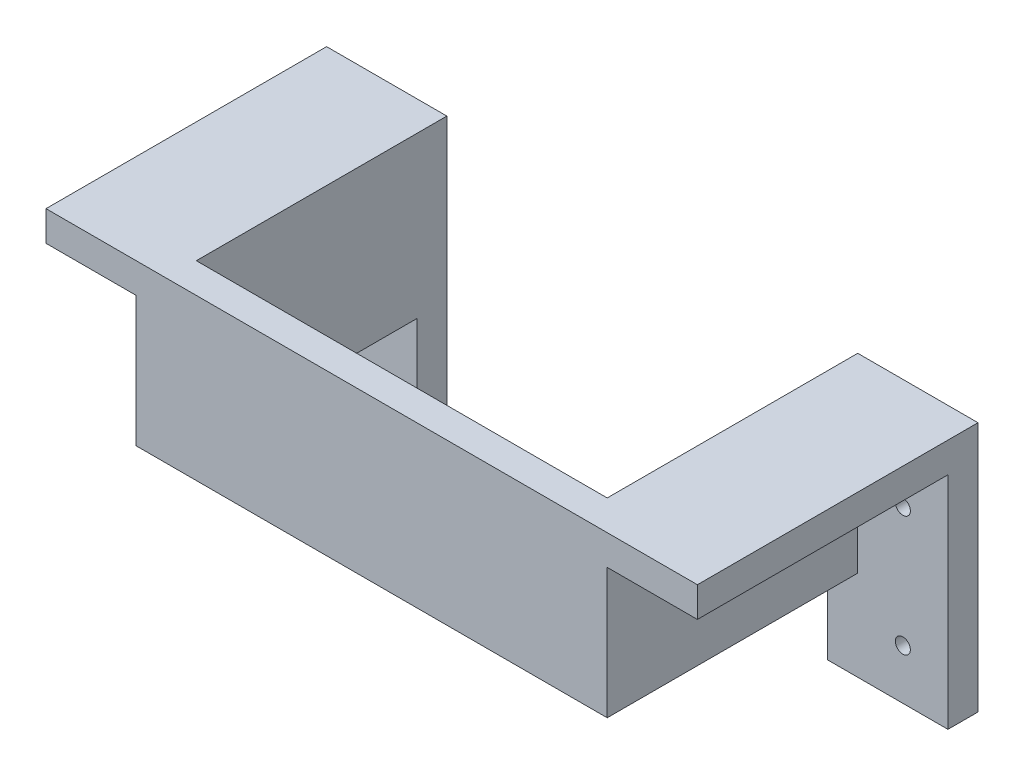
ISO-10303-21;
HEADER;
FILE_DESCRIPTION(('STEP AP214'),'2;1');
FILE_NAME('part.step','',(''),(''),'','','');
FILE_SCHEMA(('AUTOMOTIVE_DESIGN { 1 0 10303 214 1 1 1 1 }'));
ENDSEC;
DATA;
#1=APPLICATION_CONTEXT('core data for automotive mechanical design processes');
#2=APPLICATION_PROTOCOL_DEFINITION('international standard','automotive_design',2000,#1);
#3=PRODUCT_CONTEXT('',#1,'mechanical');
#4=PRODUCT('Part','Part','',(#3));
#5=PRODUCT_RELATED_PRODUCT_CATEGORY('part','',(#4));
#6=PRODUCT_DEFINITION_FORMATION('','',#4);
#7=PRODUCT_DEFINITION_CONTEXT('part definition',#1,'design');
#8=PRODUCT_DEFINITION('design','',#6,#7);
#9=PRODUCT_DEFINITION_SHAPE('','',#8);
#10=(LENGTH_UNIT() NAMED_UNIT(*) SI_UNIT(.MILLI.,.METRE.));
#11=(NAMED_UNIT(*) PLANE_ANGLE_UNIT() SI_UNIT($,.RADIAN.));
#12=(NAMED_UNIT(*) SI_UNIT($,.STERADIAN.) SOLID_ANGLE_UNIT());
#13=UNCERTAINTY_MEASURE_WITH_UNIT(LENGTH_MEASURE(1.E-05),#10,'distance_accuracy_value','');
#14=(GEOMETRIC_REPRESENTATION_CONTEXT(3) GLOBAL_UNCERTAINTY_ASSIGNED_CONTEXT((#13)) GLOBAL_UNIT_ASSIGNED_CONTEXT((#10,
#11,#12)) REPRESENTATION_CONTEXT('',''));
#15=CARTESIAN_POINT('',(0.,0.,0.));
#16=DIRECTION('',(0.,0.,1.));
#17=DIRECTION('',(1.,0.,0.));
#18=AXIS2_PLACEMENT_3D('',#15,#16,#17);
#19=CARTESIAN_POINT('',(-53.,0.,28.));
#20=DIRECTION('',(-1.,0.,0.));
#21=DIRECTION('',(0.,0.,1.));
#22=AXIS2_PLACEMENT_3D('',#19,#20,#21);
#23=PLANE('',#22);
#24=DIRECTION('',(0.,1.,0.));
#25=VECTOR('',#24,1.);
#26=CARTESIAN_POINT('',(-53.,0.,25.));
#27=LINE('',#26,#25);
#28=CARTESIAN_POINT('',(-53.,-16.,25.));
#29=VERTEX_POINT('',#28);
#30=CARTESIAN_POINT('',(-53.,0.,25.));
#31=VERTEX_POINT('',#30);
#32=EDGE_CURVE('E52',#29,#31,#27,.T.);
#33=ORIENTED_EDGE('',*,*,#32,.F.);
#34=DIRECTION('',(0.,0.,-1.));
#35=VECTOR('',#34,1.);
#36=CARTESIAN_POINT('',(-53.,-16.,28.));
#37=LINE('',#36,#35);
#38=CARTESIAN_POINT('',(-53.,-16.,3.));
#39=VERTEX_POINT('',#38);
#40=EDGE_CURVE('E223',#29,#39,#37,.T.);
#41=ORIENTED_EDGE('',*,*,#40,.T.);
#42=DIRECTION('',(0.,-1.,0.));
#43=VECTOR('',#42,1.);
#44=CARTESIAN_POINT('',(-53.,0.,3.));
#45=LINE('',#44,#43);
#46=CARTESIAN_POINT('',(-53.,-25.,3.));
#47=VERTEX_POINT('',#46);
#48=EDGE_CURVE('E11',#39,#47,#45,.T.);
#49=ORIENTED_EDGE('',*,*,#48,.T.);
#50=DIRECTION('',(0.,0.,1.));
#51=VECTOR('',#50,1.);
#52=CARTESIAN_POINT('',(-53.,-25.,0.));
#53=LINE('',#52,#51);
#54=CARTESIAN_POINT('',(-53.,-25.,0.));
#55=VERTEX_POINT('',#54);
#56=EDGE_CURVE('E207',#55,#47,#53,.T.);
#57=ORIENTED_EDGE('',*,*,#56,.F.);
#58=DIRECTION('',(0.,-1.,0.));
#59=VECTOR('',#58,1.);
#60=CARTESIAN_POINT('',(-53.,0.,0.));
#61=LINE('',#60,#59);
#62=CARTESIAN_POINT('',(-53.,0.,0.));
#63=VERTEX_POINT('',#62);
#64=EDGE_CURVE('E206',#63,#55,#61,.T.);
#65=ORIENTED_EDGE('',*,*,#64,.F.);
#66=DIRECTION('',(0.,0.,-1.));
#67=VECTOR('',#66,1.);
#68=CARTESIAN_POINT('',(-53.,0.,28.));
#69=LINE('',#68,#67);
#70=EDGE_CURVE('E60',#31,#63,#69,.T.);
#71=ORIENTED_EDGE('',*,*,#70,.F.);
#72=EDGE_LOOP('',(#33,#41,#49,#57,#65,#71));
#73=FACE_BOUND('',#72,.T.);
#74=ADVANCED_FACE('F35',(#73),#23,.F.);
#75=CARTESIAN_POINT('',(0.,0.,3.));
#76=DIRECTION('',(0.,0.,-1.));
#77=DIRECTION('',(-1.,0.,0.));
#78=AXIS2_PLACEMENT_3D('',#75,#76,#77);
#79=PLANE('',#78);
#80=CARTESIAN_POINT('',(-60.5,-8.,3.));
#81=DIRECTION('',(0.,0.,1.));
#82=DIRECTION('',(1.,0.,0.));
#83=AXIS2_PLACEMENT_3D('',#80,#81,#82);
#84=CIRCLE('',#83,0.749999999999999);
#85=CARTESIAN_POINT('',(-59.75,-8.,3.));
#86=VERTEX_POINT('',#85);
#87=EDGE_CURVE('E236',#86,#86,#84,.T.);
#88=ORIENTED_EDGE('',*,*,#87,.F.);
#89=EDGE_LOOP('',(#88));
#90=FACE_BOUND('',#89,.T.);
#91=CARTESIAN_POINT('',(-60.5,-20.,3.));
#92=DIRECTION('',(0.,0.,1.));
#93=DIRECTION('',(1.,0.,0.));
#94=AXIS2_PLACEMENT_3D('',#91,#92,#93);
#95=CIRCLE('',#94,0.749999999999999);
#96=CARTESIAN_POINT('',(-59.75,-20.,3.));
#97=VERTEX_POINT('',#96);
#98=EDGE_CURVE('E44',#97,#97,#95,.T.);
#99=ORIENTED_EDGE('',*,*,#98,.F.);
#100=EDGE_LOOP('',(#99));
#101=FACE_BOUND('',#100,.T.);
#102=DIRECTION('',(1.,0.,0.));
#103=VECTOR('',#102,1.);
#104=CARTESIAN_POINT('',(0.,-25.,3.));
#105=LINE('',#104,#103);
#106=CARTESIAN_POINT('',(-65.,-25.,3.));
#107=VERTEX_POINT('',#106);
#108=EDGE_CURVE('E191',#107,#47,#105,.T.);
#109=ORIENTED_EDGE('',*,*,#108,.T.);
#110=ORIENTED_EDGE('',*,*,#48,.F.);
#111=DIRECTION('',(1.,0.,0.));
#112=VECTOR('',#111,1.);
#113=CARTESIAN_POINT('',(-53.,-16.,3.));
#114=LINE('',#113,#112);
#115=CARTESIAN_POINT('',(-56.,-16.,3.));
#116=VERTEX_POINT('',#115);
#117=EDGE_CURVE('E219',#116,#39,#114,.T.);
#118=ORIENTED_EDGE('',*,*,#117,.F.);
#119=DIRECTION('',(0.,-1.,0.));
#120=VECTOR('',#119,1.);
#121=CARTESIAN_POINT('',(-56.,-16.,3.));
#122=LINE('',#121,#120);
#123=CARTESIAN_POINT('',(-56.,-3.,3.));
#124=VERTEX_POINT('',#123);
#125=EDGE_CURVE('E215',#124,#116,#122,.T.);
#126=ORIENTED_EDGE('',*,*,#125,.F.);
#127=DIRECTION('',(1.,0.,0.));
#128=VECTOR('',#127,1.);
#129=CARTESIAN_POINT('',(-56.,-3.,3.));
#130=LINE('',#129,#128);
#131=CARTESIAN_POINT('',(-65.,-3.,3.));
#132=VERTEX_POINT('',#131);
#133=EDGE_CURVE('E201',#132,#124,#130,.T.);
#134=ORIENTED_EDGE('',*,*,#133,.F.);
#135=DIRECTION('',(0.,-1.,0.));
#136=VECTOR('',#135,1.);
#137=CARTESIAN_POINT('',(-65.,0.,3.));
#138=LINE('',#137,#136);
#139=EDGE_CURVE('E210',#132,#107,#138,.T.);
#140=ORIENTED_EDGE('',*,*,#139,.T.);
#141=EDGE_LOOP('',(#109,#110,#118,#126,#134,#140));
#142=FACE_BOUND('',#141,.T.);
#143=ADVANCED_FACE('F37',(#90,#101,#142),#79,.F.);
#144=CARTESIAN_POINT('',(0.,0.,3.));
#145=DIRECTION('',(0.,-1.,0.));
#146=DIRECTION('',(0.,0.,-1.));
#147=AXIS2_PLACEMENT_3D('',#144,#145,#146);
#148=PLANE('',#147);
#149=DIRECTION('',(-1.,0.,0.));
#150=VECTOR('',#149,1.);
#151=CARTESIAN_POINT('',(-65.,0.,28.));
#152=LINE('',#151,#150);
#153=CARTESIAN_POINT('',(0.,0.,28.));
#154=VERTEX_POINT('',#153);
#155=CARTESIAN_POINT('',(-65.,0.,28.));
#156=VERTEX_POINT('',#155);
#157=EDGE_CURVE('E233',#154,#156,#152,.T.);
#158=ORIENTED_EDGE('',*,*,#157,.F.);
#159=DIRECTION('',(0.,0.,-1.));
#160=VECTOR('',#159,1.);
#161=CARTESIAN_POINT('',(0.,0.,3.));
#162=LINE('',#161,#160);
#163=CARTESIAN_POINT('',(0.,0.,0.));
#164=VERTEX_POINT('',#163);
#165=EDGE_CURVE('E186',#154,#164,#162,.T.);
#166=ORIENTED_EDGE('',*,*,#165,.T.);
#167=DIRECTION('',(-1.,0.,0.));
#168=VECTOR('',#167,1.);
#169=CARTESIAN_POINT('',(0.,0.,0.));
#170=LINE('',#169,#168);
#171=CARTESIAN_POINT('',(-12.,0.,0.));
#172=VERTEX_POINT('',#171);
#173=EDGE_CURVE('E178',#164,#172,#170,.T.);
#174=ORIENTED_EDGE('',*,*,#173,.T.);
#175=DIRECTION('',(0.,0.,-1.));
#176=VECTOR('',#175,1.);
#177=CARTESIAN_POINT('',(-12.,0.,28.));
#178=LINE('',#177,#176);
#179=CARTESIAN_POINT('',(-12.,0.,25.));
#180=VERTEX_POINT('',#179);
#181=EDGE_CURVE('E157',#180,#172,#178,.T.);
#182=ORIENTED_EDGE('',*,*,#181,.F.);
#183=DIRECTION('',(-1.,0.,0.));
#184=VECTOR('',#183,1.);
#185=CARTESIAN_POINT('',(500000.,0.,25.));
#186=LINE('',#185,#184);
#187=EDGE_CURVE('E192',#180,#31,#186,.T.);
#188=ORIENTED_EDGE('',*,*,#187,.T.);
#189=ORIENTED_EDGE('',*,*,#70,.T.);
#190=DIRECTION('',(-1.,0.,0.));
#191=VECTOR('',#190,1.);
#192=CARTESIAN_POINT('',(0.,0.,0.));
#193=LINE('',#192,#191);
#194=CARTESIAN_POINT('',(-65.,0.,0.));
#195=VERTEX_POINT('',#194);
#196=EDGE_CURVE('E39',#63,#195,#193,.T.);
#197=ORIENTED_EDGE('',*,*,#196,.T.);
#198=DIRECTION('',(0.,0.,-1.));
#199=VECTOR('',#198,1.);
#200=CARTESIAN_POINT('',(-65.,0.,3.));
#201=LINE('',#200,#199);
#202=EDGE_CURVE('E198',#156,#195,#201,.T.);
#203=ORIENTED_EDGE('',*,*,#202,.F.);
#204=EDGE_LOOP('',(#158,#166,#174,#182,#188,#189,#197,#203));
#205=FACE_BOUND('',#204,.T.);
#206=ADVANCED_FACE('F264',(#205),#148,.F.);
#207=CARTESIAN_POINT('',(0.,-25.,3.));
#208=DIRECTION('',(0.,1.,0.));
#209=DIRECTION('',(-1.,0.,0.));
#210=AXIS2_PLACEMENT_3D('',#207,#208,#209);
#211=PLANE('',#210);
#212=DIRECTION('',(1.,0.,0.));
#213=VECTOR('',#212,1.);
#214=CARTESIAN_POINT('',(0.,-25.,0.));
#215=LINE('',#214,#213);
#216=CARTESIAN_POINT('',(-65.,-25.,0.));
#217=VERTEX_POINT('',#216);
#218=EDGE_CURVE('E255',#217,#55,#215,.T.);
#219=ORIENTED_EDGE('',*,*,#218,.T.);
#220=ORIENTED_EDGE('',*,*,#56,.T.);
#221=ORIENTED_EDGE('',*,*,#108,.F.);
#222=DIRECTION('',(0.,0.,-1.));
#223=VECTOR('',#222,1.);
#224=CARTESIAN_POINT('',(-65.,-25.,3.));
#225=LINE('',#224,#223);
#226=EDGE_CURVE('E203',#107,#217,#225,.T.);
#227=ORIENTED_EDGE('',*,*,#226,.T.);
#228=EDGE_LOOP('',(#219,#220,#221,#227));
#229=FACE_BOUND('',#228,.T.);
#230=ADVANCED_FACE('F276',(#229),#211,.F.);
#231=CARTESIAN_POINT('',(0.,0.,0.));
#232=DIRECTION('',(0.,0.,-1.));
#233=DIRECTION('',(-1.,0.,0.));
#234=AXIS2_PLACEMENT_3D('',#231,#232,#233);
#235=PLANE('',#234);
#236=ORIENTED_EDGE('',*,*,#64,.T.);
#237=ORIENTED_EDGE('',*,*,#218,.F.);
#238=DIRECTION('',(0.,-1.,0.));
#239=VECTOR('',#238,1.);
#240=CARTESIAN_POINT('',(-65.,0.,0.));
#241=LINE('',#240,#239);
#242=EDGE_CURVE('E202',#195,#217,#241,.T.);
#243=ORIENTED_EDGE('',*,*,#242,.F.);
#244=ORIENTED_EDGE('',*,*,#196,.F.);
#245=EDGE_LOOP('',(#236,#237,#243,#244));
#246=FACE_BOUND('',#245,.T.);
#247=CARTESIAN_POINT('',(-60.5,-8.,0.));
#248=DIRECTION('',(0.,0.,1.));
#249=DIRECTION('',(1.,0.,0.));
#250=AXIS2_PLACEMENT_3D('',#247,#248,#249);
#251=CIRCLE('',#250,0.749999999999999);
#252=CARTESIAN_POINT('',(-59.75,-8.,0.));
#253=VERTEX_POINT('',#252);
#254=EDGE_CURVE('E247',#253,#253,#251,.T.);
#255=ORIENTED_EDGE('',*,*,#254,.T.);
#256=EDGE_LOOP('',(#255));
#257=FACE_BOUND('',#256,.T.);
#258=CARTESIAN_POINT('',(-60.5,-20.,0.));
#259=DIRECTION('',(0.,0.,1.));
#260=DIRECTION('',(1.,0.,0.));
#261=AXIS2_PLACEMENT_3D('',#258,#259,#260);
#262=CIRCLE('',#261,0.749999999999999);
#263=CARTESIAN_POINT('',(-59.75,-20.,0.));
#264=VERTEX_POINT('',#263);
#265=EDGE_CURVE('E209',#264,#264,#262,.T.);
#266=ORIENTED_EDGE('',*,*,#265,.T.);
#267=EDGE_LOOP('',(#266));
#268=FACE_BOUND('',#267,.T.);
#269=ADVANCED_FACE('F272',(#246,#257,#268),#235,.T.);
#270=CARTESIAN_POINT('',(-65.,0.,3.));
#271=DIRECTION('',(1.,0.,0.));
#272=DIRECTION('',(0.,0.,-1.));
#273=AXIS2_PLACEMENT_3D('',#270,#271,#272);
#274=PLANE('',#273);
#275=ORIENTED_EDGE('',*,*,#242,.T.);
#276=ORIENTED_EDGE('',*,*,#226,.F.);
#277=ORIENTED_EDGE('',*,*,#139,.F.);
#278=DIRECTION('',(0.,0.,-1.));
#279=VECTOR('',#278,1.);
#280=CARTESIAN_POINT('',(-65.,-3.,28.));
#281=LINE('',#280,#279);
#282=CARTESIAN_POINT('',(-65.,-3.,28.));
#283=VERTEX_POINT('',#282);
#284=EDGE_CURVE('E212',#283,#132,#281,.T.);
#285=ORIENTED_EDGE('',*,*,#284,.F.);
#286=DIRECTION('',(0.,-1.,0.));
#287=VECTOR('',#286,1.);
#288=CARTESIAN_POINT('',(-65.,-3.,28.));
#289=LINE('',#288,#287);
#290=EDGE_CURVE('E225',#156,#283,#289,.T.);
#291=ORIENTED_EDGE('',*,*,#290,.F.);
#292=ORIENTED_EDGE('',*,*,#202,.T.);
#293=EDGE_LOOP('',(#275,#276,#277,#285,#291,#292));
#294=FACE_BOUND('',#293,.T.);
#295=ADVANCED_FACE('F269',(#294),#274,.F.);
#296=CARTESIAN_POINT('',(-56.,-3.,28.));
#297=DIRECTION('',(0.,1.,0.));
#298=DIRECTION('',(-1.,0.,0.));
#299=AXIS2_PLACEMENT_3D('',#296,#297,#298);
#300=PLANE('',#299);
#301=ORIENTED_EDGE('',*,*,#133,.T.);
#302=DIRECTION('',(0.,0.,-1.));
#303=VECTOR('',#302,1.);
#304=CARTESIAN_POINT('',(-56.,-3.,28.));
#305=LINE('',#304,#303);
#306=CARTESIAN_POINT('',(-56.,-3.,28.));
#307=VERTEX_POINT('',#306);
#308=EDGE_CURVE('E216',#307,#124,#305,.T.);
#309=ORIENTED_EDGE('',*,*,#308,.F.);
#310=DIRECTION('',(1.,0.,0.));
#311=VECTOR('',#310,1.);
#312=CARTESIAN_POINT('',(-56.,-3.,28.));
#313=LINE('',#312,#311);
#314=EDGE_CURVE('E241',#283,#307,#313,.T.);
#315=ORIENTED_EDGE('',*,*,#314,.F.);
#316=ORIENTED_EDGE('',*,*,#284,.T.);
#317=EDGE_LOOP('',(#301,#309,#315,#316));
#318=FACE_BOUND('',#317,.T.);
#319=ADVANCED_FACE('F280',(#318),#300,.F.);
#320=CARTESIAN_POINT('',(-56.,-16.,28.));
#321=DIRECTION('',(1.,0.,0.));
#322=DIRECTION('',(0.,0.,-1.));
#323=AXIS2_PLACEMENT_3D('',#320,#321,#322);
#324=PLANE('',#323);
#325=ORIENTED_EDGE('',*,*,#125,.T.);
#326=DIRECTION('',(0.,0.,-1.));
#327=VECTOR('',#326,1.);
#328=CARTESIAN_POINT('',(-56.,-16.,28.));
#329=LINE('',#328,#327);
#330=CARTESIAN_POINT('',(-56.,-16.,28.));
#331=VERTEX_POINT('',#330);
#332=EDGE_CURVE('E220',#331,#116,#329,.T.);
#333=ORIENTED_EDGE('',*,*,#332,.F.);
#334=DIRECTION('',(0.,-1.,0.));
#335=VECTOR('',#334,1.);
#336=CARTESIAN_POINT('',(-56.,-16.,28.));
#337=LINE('',#336,#335);
#338=EDGE_CURVE('E239',#307,#331,#337,.T.);
#339=ORIENTED_EDGE('',*,*,#338,.F.);
#340=ORIENTED_EDGE('',*,*,#308,.T.);
#341=EDGE_LOOP('',(#325,#333,#339,#340));
#342=FACE_BOUND('',#341,.T.);
#343=ADVANCED_FACE('F347',(#342),#324,.F.);
#344=CARTESIAN_POINT('',(-53.,-16.,28.));
#345=DIRECTION('',(0.,1.,0.));
#346=DIRECTION('',(0.,0.,1.));
#347=AXIS2_PLACEMENT_3D('',#344,#345,#346);
#348=PLANE('',#347);
#349=ORIENTED_EDGE('',*,*,#117,.T.);
#350=ORIENTED_EDGE('',*,*,#40,.F.);
#351=DIRECTION('',(-1.,0.,0.));
#352=VECTOR('',#351,1.);
#353=CARTESIAN_POINT('',(500000.,-16.,25.));
#354=LINE('',#353,#352);
#355=CARTESIAN_POINT('',(-12.0000000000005,-16.,25.));
#356=VERTEX_POINT('',#355);
#357=EDGE_CURVE('E193',#356,#29,#354,.T.);
#358=ORIENTED_EDGE('',*,*,#357,.F.);
#359=DIRECTION('',(0.,0.,-1.));
#360=VECTOR('',#359,1.);
#361=CARTESIAN_POINT('',(-12.,-16.,28.));
#362=LINE('',#361,#360);
#363=CARTESIAN_POINT('',(-12.,-16.,3.));
#364=VERTEX_POINT('',#363);
#365=EDGE_CURVE('E298',#356,#364,#362,.T.);
#366=ORIENTED_EDGE('',*,*,#365,.T.);
#367=DIRECTION('',(1.,0.,0.));
#368=VECTOR('',#367,1.);
#369=CARTESIAN_POINT('',(-12.,-16.,3.));
#370=LINE('',#369,#368);
#371=CARTESIAN_POINT('',(-8.99999999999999,-16.,3.));
#372=VERTEX_POINT('',#371);
#373=EDGE_CURVE('E311',#364,#372,#370,.T.);
#374=ORIENTED_EDGE('',*,*,#373,.T.);
#375=DIRECTION('',(0.,0.,-1.));
#376=VECTOR('',#375,1.);
#377=CARTESIAN_POINT('',(-8.99999999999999,-16.,28.));
#378=LINE('',#377,#376);
#379=CARTESIAN_POINT('',(-8.99999999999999,-16.,28.));
#380=VERTEX_POINT('',#379);
#381=EDGE_CURVE('E300',#380,#372,#378,.T.);
#382=ORIENTED_EDGE('',*,*,#381,.F.);
#383=DIRECTION('',(1.,0.,0.));
#384=VECTOR('',#383,1.);
#385=CARTESIAN_POINT('',(-53.,-16.,28.));
#386=LINE('',#385,#384);
#387=EDGE_CURVE('E237',#331,#380,#386,.T.);
#388=ORIENTED_EDGE('',*,*,#387,.F.);
#389=ORIENTED_EDGE('',*,*,#332,.T.);
#390=EDGE_LOOP('',(#349,#350,#358,#366,#374,#382,#388,#389));
#391=FACE_BOUND('',#390,.T.);
#392=ADVANCED_FACE('F336',(#391),#348,.F.);
#393=CARTESIAN_POINT('',(0.,0.,28.));
#394=DIRECTION('',(0.,0.,-1.));
#395=DIRECTION('',(-1.,0.,0.));
#396=AXIS2_PLACEMENT_3D('',#393,#394,#395);
#397=PLANE('',#396);
#398=ORIENTED_EDGE('',*,*,#290,.T.);
#399=ORIENTED_EDGE('',*,*,#314,.T.);
#400=ORIENTED_EDGE('',*,*,#338,.T.);
#401=ORIENTED_EDGE('',*,*,#387,.T.);
#402=DIRECTION('',(0.,1.,0.));
#403=VECTOR('',#402,1.);
#404=CARTESIAN_POINT('',(-8.99999999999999,-16.,28.));
#405=LINE('',#404,#403);
#406=CARTESIAN_POINT('',(-9.,-2.99999999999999,28.));
#407=VERTEX_POINT('',#406);
#408=EDGE_CURVE('E306',#380,#407,#405,.T.);
#409=ORIENTED_EDGE('',*,*,#408,.T.);
#410=DIRECTION('',(1.,0.,0.));
#411=VECTOR('',#410,1.);
#412=CARTESIAN_POINT('',(-9.,-2.99999999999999,28.));
#413=LINE('',#412,#411);
#414=CARTESIAN_POINT('',(0.,-3.,28.));
#415=VERTEX_POINT('',#414);
#416=EDGE_CURVE('E310',#407,#415,#413,.T.);
#417=ORIENTED_EDGE('',*,*,#416,.T.);
#418=DIRECTION('',(0.,1.,0.));
#419=VECTOR('',#418,1.);
#420=CARTESIAN_POINT('',(0.,-3.,28.));
#421=LINE('',#420,#419);
#422=EDGE_CURVE('E287',#415,#154,#421,.T.);
#423=ORIENTED_EDGE('',*,*,#422,.T.);
#424=ORIENTED_EDGE('',*,*,#157,.T.);
#425=EDGE_LOOP('',(#398,#399,#400,#401,#409,#417,#423,#424));
#426=FACE_BOUND('',#425,.T.);
#427=ADVANCED_FACE('F284',(#426),#397,.F.);
#428=CARTESIAN_POINT('',(-60.5,-8.,0.));
#429=DIRECTION('',(0.,0.,1.));
#430=DIRECTION('',(1.,0.,0.));
#431=AXIS2_PLACEMENT_3D('',#428,#429,#430);
#432=CYLINDRICAL_SURFACE('',#431,0.749999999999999);
#433=ORIENTED_EDGE('',*,*,#254,.F.);
#434=EDGE_LOOP('',(#433));
#435=FACE_BOUND('',#434,.T.);
#436=ORIENTED_EDGE('',*,*,#87,.T.);
#437=EDGE_LOOP('',(#436));
#438=FACE_BOUND('',#437,.T.);
#439=ADVANCED_FACE('F368',(#435,#438),#432,.F.);
#440=CARTESIAN_POINT('',(-60.5,-20.,0.));
#441=DIRECTION('',(0.,0.,1.));
#442=DIRECTION('',(1.,0.,0.));
#443=AXIS2_PLACEMENT_3D('',#440,#441,#442);
#444=CYLINDRICAL_SURFACE('',#443,0.749999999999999);
#445=ORIENTED_EDGE('',*,*,#265,.F.);
#446=EDGE_LOOP('',(#445));
#447=FACE_BOUND('',#446,.T.);
#448=ORIENTED_EDGE('',*,*,#98,.T.);
#449=EDGE_LOOP('',(#448));
#450=FACE_BOUND('',#449,.T.);
#451=ADVANCED_FACE('F370',(#447,#450),#444,.F.);
#452=CARTESIAN_POINT('',(500000.,0.,25.));
#453=DIRECTION('',(0.,0.,1.));
#454=DIRECTION('',(0.,-1.,0.));
#455=AXIS2_PLACEMENT_3D('',#452,#453,#454);
#456=PLANE('',#455);
#457=DIRECTION('',(0.,1.,0.));
#458=VECTOR('',#457,1.);
#459=CARTESIAN_POINT('',(-12.0000000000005,-2.16845638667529E-10,25.));
#460=LINE('',#459,#458);
#461=EDGE_CURVE('E189',#356,#180,#460,.T.);
#462=ORIENTED_EDGE('',*,*,#461,.F.);
#463=ORIENTED_EDGE('',*,*,#357,.T.);
#464=ORIENTED_EDGE('',*,*,#32,.T.);
#465=ORIENTED_EDGE('',*,*,#187,.F.);
#466=EDGE_LOOP('',(#462,#463,#464,#465));
#467=FACE_BOUND('',#466,.T.);
#468=ADVANCED_FACE('F374',(#467),#456,.F.);
#469=CARTESIAN_POINT('',(-12.,0.,28.));
#470=DIRECTION('',(1.,0.,0.));
#471=DIRECTION('',(0.,1.,0.));
#472=AXIS2_PLACEMENT_3D('',#469,#470,#471);
#473=PLANE('',#472);
#474=ORIENTED_EDGE('',*,*,#365,.F.);
#475=ORIENTED_EDGE('',*,*,#461,.T.);
#476=ORIENTED_EDGE('',*,*,#181,.T.);
#477=DIRECTION('',(0.,1.,0.));
#478=VECTOR('',#477,1.);
#479=CARTESIAN_POINT('',(-12.,0.,0.));
#480=LINE('',#479,#478);
#481=CARTESIAN_POINT('',(-12.,-25.,0.));
#482=VERTEX_POINT('',#481);
#483=EDGE_CURVE('E148',#482,#172,#480,.T.);
#484=ORIENTED_EDGE('',*,*,#483,.F.);
#485=DIRECTION('',(0.,0.,1.));
#486=VECTOR('',#485,1.);
#487=CARTESIAN_POINT('',(-12.,-25.,0.));
#488=LINE('',#487,#486);
#489=CARTESIAN_POINT('',(-12.,-25.,3.));
#490=VERTEX_POINT('',#489);
#491=EDGE_CURVE('E153',#482,#490,#488,.T.);
#492=ORIENTED_EDGE('',*,*,#491,.T.);
#493=DIRECTION('',(0.,1.,0.));
#494=VECTOR('',#493,1.);
#495=CARTESIAN_POINT('',(-12.,0.,3.));
#496=LINE('',#495,#494);
#497=EDGE_CURVE('E161',#490,#364,#496,.T.);
#498=ORIENTED_EDGE('',*,*,#497,.T.);
#499=EDGE_LOOP('',(#474,#475,#476,#484,#492,#498));
#500=FACE_BOUND('',#499,.T.);
#501=ADVANCED_FACE('F151',(#500),#473,.F.);
#502=CARTESIAN_POINT('',(-8.99999999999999,-16.,28.));
#503=DIRECTION('',(-1.,0.,0.));
#504=DIRECTION('',(0.,-1.,0.));
#505=AXIS2_PLACEMENT_3D('',#502,#503,#504);
#506=PLANE('',#505);
#507=DIRECTION('',(0.,1.,0.));
#508=VECTOR('',#507,1.);
#509=CARTESIAN_POINT('',(-8.99999999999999,-16.,3.));
#510=LINE('',#509,#508);
#511=CARTESIAN_POINT('',(-9.,-2.99999999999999,3.));
#512=VERTEX_POINT('',#511);
#513=EDGE_CURVE('E307',#372,#512,#510,.T.);
#514=ORIENTED_EDGE('',*,*,#513,.T.);
#515=DIRECTION('',(0.,0.,-1.));
#516=VECTOR('',#515,1.);
#517=CARTESIAN_POINT('',(-9.,-2.99999999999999,28.));
#518=LINE('',#517,#516);
#519=EDGE_CURVE('E303',#407,#512,#518,.T.);
#520=ORIENTED_EDGE('',*,*,#519,.F.);
#521=ORIENTED_EDGE('',*,*,#408,.F.);
#522=ORIENTED_EDGE('',*,*,#381,.T.);
#523=EDGE_LOOP('',(#514,#520,#521,#522));
#524=FACE_BOUND('',#523,.T.);
#525=ADVANCED_FACE('F341',(#524),#506,.F.);
#526=CARTESIAN_POINT('',(-9.,-2.99999999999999,28.));
#527=DIRECTION('',(0.,1.,0.));
#528=DIRECTION('',(-1.,0.,0.));
#529=AXIS2_PLACEMENT_3D('',#526,#527,#528);
#530=PLANE('',#529);
#531=DIRECTION('',(1.,0.,0.));
#532=VECTOR('',#531,1.);
#533=CARTESIAN_POINT('',(-9.,-2.99999999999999,3.));
#534=LINE('',#533,#532);
#535=CARTESIAN_POINT('',(0.,-3.,3.));
#536=VERTEX_POINT('',#535);
#537=EDGE_CURVE('E314',#512,#536,#534,.T.);
#538=ORIENTED_EDGE('',*,*,#537,.T.);
#539=DIRECTION('',(0.,0.,-1.));
#540=VECTOR('',#539,1.);
#541=CARTESIAN_POINT('',(0.,-3.,28.));
#542=LINE('',#541,#540);
#543=EDGE_CURVE('E293',#415,#536,#542,.T.);
#544=ORIENTED_EDGE('',*,*,#543,.F.);
#545=ORIENTED_EDGE('',*,*,#416,.F.);
#546=ORIENTED_EDGE('',*,*,#519,.T.);
#547=EDGE_LOOP('',(#538,#544,#545,#546));
#548=FACE_BOUND('',#547,.T.);
#549=ADVANCED_FACE('F412',(#548),#530,.F.);
#550=CARTESIAN_POINT('',(-4.5,-8.00000000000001,0.));
#551=DIRECTION('',(0.,0.,1.));
#552=DIRECTION('',(1.,0.,0.));
#553=AXIS2_PLACEMENT_3D('',#550,#551,#552);
#554=CYLINDRICAL_SURFACE('',#553,0.749999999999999);
#555=CARTESIAN_POINT('',(-4.5,-8.00000000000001,0.));
#556=DIRECTION('',(0.,0.,1.));
#557=DIRECTION('',(-1.,0.,0.));
#558=AXIS2_PLACEMENT_3D('',#555,#556,#557);
#559=CIRCLE('',#558,0.749999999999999);
#560=CARTESIAN_POINT('',(-5.25,-8.00000000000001,0.));
#561=VERTEX_POINT('',#560);
#562=EDGE_CURVE('E323',#561,#561,#559,.T.);
#563=ORIENTED_EDGE('',*,*,#562,.F.);
#564=EDGE_LOOP('',(#563));
#565=FACE_BOUND('',#564,.T.);
#566=CARTESIAN_POINT('',(-4.5,-8.00000000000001,3.));
#567=DIRECTION('',(0.,0.,1.));
#568=DIRECTION('',(-1.,0.,0.));
#569=AXIS2_PLACEMENT_3D('',#566,#567,#568);
#570=CIRCLE('',#569,0.749999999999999);
#571=CARTESIAN_POINT('',(-5.25,-8.00000000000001,3.));
#572=VERTEX_POINT('',#571);
#573=EDGE_CURVE('E170',#572,#572,#570,.T.);
#574=ORIENTED_EDGE('',*,*,#573,.T.);
#575=EDGE_LOOP('',(#574));
#576=FACE_BOUND('',#575,.T.);
#577=ADVANCED_FACE('F420',(#565,#576),#554,.F.);
#578=CARTESIAN_POINT('',(-4.5,-20.,0.));
#579=DIRECTION('',(0.,0.,1.));
#580=DIRECTION('',(1.,0.,0.));
#581=AXIS2_PLACEMENT_3D('',#578,#579,#580);
#582=CYLINDRICAL_SURFACE('',#581,0.749999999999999);
#583=CARTESIAN_POINT('',(-4.5,-20.,0.));
#584=DIRECTION('',(0.,0.,1.));
#585=DIRECTION('',(-1.,0.,0.));
#586=AXIS2_PLACEMENT_3D('',#583,#584,#585);
#587=CIRCLE('',#586,0.749999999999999);
#588=CARTESIAN_POINT('',(-5.25,-20.,0.));
#589=VERTEX_POINT('',#588);
#590=EDGE_CURVE('E317',#589,#589,#587,.T.);
#591=ORIENTED_EDGE('',*,*,#590,.F.);
#592=EDGE_LOOP('',(#591));
#593=FACE_BOUND('',#592,.T.);
#594=CARTESIAN_POINT('',(-4.5,-20.,3.));
#595=DIRECTION('',(0.,0.,1.));
#596=DIRECTION('',(-1.,0.,0.));
#597=AXIS2_PLACEMENT_3D('',#594,#595,#596);
#598=CIRCLE('',#597,0.749999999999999);
#599=CARTESIAN_POINT('',(-5.25,-20.,3.));
#600=VERTEX_POINT('',#599);
#601=EDGE_CURVE('E326',#600,#600,#598,.T.);
#602=ORIENTED_EDGE('',*,*,#601,.T.);
#603=EDGE_LOOP('',(#602));
#604=FACE_BOUND('',#603,.T.);
#605=ADVANCED_FACE('F429',(#593,#604),#582,.F.);
#606=CARTESIAN_POINT('',(0.,0.,3.));
#607=DIRECTION('',(-1.,0.,0.));
#608=DIRECTION('',(0.,-1.,0.));
#609=AXIS2_PLACEMENT_3D('',#606,#607,#608);
#610=PLANE('',#609);
#611=DIRECTION('',(0.,1.,0.));
#612=VECTOR('',#611,1.);
#613=CARTESIAN_POINT('',(0.,0.,0.));
#614=LINE('',#613,#612);
#615=CARTESIAN_POINT('',(0.,-25.,0.));
#616=VERTEX_POINT('',#615);
#617=EDGE_CURVE('E176',#616,#164,#614,.T.);
#618=ORIENTED_EDGE('',*,*,#617,.T.);
#619=ORIENTED_EDGE('',*,*,#165,.F.);
#620=ORIENTED_EDGE('',*,*,#422,.F.);
#621=ORIENTED_EDGE('',*,*,#543,.T.);
#622=DIRECTION('',(0.,1.,0.));
#623=VECTOR('',#622,1.);
#624=CARTESIAN_POINT('',(0.,0.,3.));
#625=LINE('',#624,#623);
#626=CARTESIAN_POINT('',(0.,-25.,3.));
#627=VERTEX_POINT('',#626);
#628=EDGE_CURVE('E177',#627,#536,#625,.T.);
#629=ORIENTED_EDGE('',*,*,#628,.F.);
#630=DIRECTION('',(0.,0.,-1.));
#631=VECTOR('',#630,1.);
#632=CARTESIAN_POINT('',(0.,-25.,3.));
#633=LINE('',#632,#631);
#634=EDGE_CURVE('E184',#627,#616,#633,.T.);
#635=ORIENTED_EDGE('',*,*,#634,.T.);
#636=EDGE_LOOP('',(#618,#619,#620,#621,#629,#635));
#637=FACE_BOUND('',#636,.T.);
#638=ADVANCED_FACE('F290',(#637),#610,.F.);
#639=CARTESIAN_POINT('',(0.,0.,0.));
#640=DIRECTION('',(0.,0.,-1.));
#641=DIRECTION('',(-1.,0.,0.));
#642=AXIS2_PLACEMENT_3D('',#639,#640,#641);
#643=PLANE('',#642);
#644=ORIENTED_EDGE('',*,*,#483,.T.);
#645=ORIENTED_EDGE('',*,*,#173,.F.);
#646=ORIENTED_EDGE('',*,*,#617,.F.);
#647=DIRECTION('',(1.,0.,0.));
#648=VECTOR('',#647,1.);
#649=CARTESIAN_POINT('',(0.,-25.,0.));
#650=LINE('',#649,#648);
#651=EDGE_CURVE('E167',#482,#616,#650,.T.);
#652=ORIENTED_EDGE('',*,*,#651,.F.);
#653=EDGE_LOOP('',(#644,#645,#646,#652));
#654=FACE_BOUND('',#653,.T.);
#655=ORIENTED_EDGE('',*,*,#590,.T.);
#656=EDGE_LOOP('',(#655));
#657=FACE_BOUND('',#656,.T.);
#658=ORIENTED_EDGE('',*,*,#562,.T.);
#659=EDGE_LOOP('',(#658));
#660=FACE_BOUND('',#659,.T.);
#661=ADVANCED_FACE('F173',(#654,#657,#660),#643,.T.);
#662=CARTESIAN_POINT('',(0.,-25.,3.));
#663=DIRECTION('',(0.,1.,0.));
#664=DIRECTION('',(-1.,0.,0.));
#665=AXIS2_PLACEMENT_3D('',#662,#663,#664);
#666=PLANE('',#665);
#667=DIRECTION('',(1.,0.,0.));
#668=VECTOR('',#667,1.);
#669=CARTESIAN_POINT('',(0.,-25.,3.));
#670=LINE('',#669,#668);
#671=EDGE_CURVE('E169',#490,#627,#670,.T.);
#672=ORIENTED_EDGE('',*,*,#671,.F.);
#673=ORIENTED_EDGE('',*,*,#491,.F.);
#674=ORIENTED_EDGE('',*,*,#651,.T.);
#675=ORIENTED_EDGE('',*,*,#634,.F.);
#676=EDGE_LOOP('',(#672,#673,#674,#675));
#677=FACE_BOUND('',#676,.T.);
#678=ADVANCED_FACE('F165',(#677),#666,.F.);
#679=CARTESIAN_POINT('',(0.,0.,3.));
#680=DIRECTION('',(0.,0.,-1.));
#681=DIRECTION('',(-1.,0.,0.));
#682=AXIS2_PLACEMENT_3D('',#679,#680,#681);
#683=PLANE('',#682);
#684=ORIENTED_EDGE('',*,*,#601,.F.);
#685=EDGE_LOOP('',(#684));
#686=FACE_BOUND('',#685,.T.);
#687=ORIENTED_EDGE('',*,*,#573,.F.);
#688=EDGE_LOOP('',(#687));
#689=FACE_BOUND('',#688,.T.);
#690=ORIENTED_EDGE('',*,*,#373,.F.);
#691=ORIENTED_EDGE('',*,*,#497,.F.);
#692=ORIENTED_EDGE('',*,*,#671,.T.);
#693=ORIENTED_EDGE('',*,*,#628,.T.);
#694=ORIENTED_EDGE('',*,*,#537,.F.);
#695=ORIENTED_EDGE('',*,*,#513,.F.);
#696=EDGE_LOOP('',(#690,#691,#692,#693,#694,#695));
#697=FACE_BOUND('',#696,.T.);
#698=ADVANCED_FACE('F333',(#686,#689,#697),#683,.F.);
#699=CLOSED_SHELL('',(#74,#143,#206,#230,#269,#295,#319,#343,#392,#427,#439,#451,#468,#501,#525,
#549,#577,#605,#638,#661,#678,#698));
#700=MANIFOLD_SOLID_BREP('B2',#699);
#701=ADVANCED_BREP_SHAPE_REPRESENTATION('',(#18,#700),#14);
#702=SHAPE_DEFINITION_REPRESENTATION(#9,#701);
ENDSEC;
END-ISO-10303-21;
